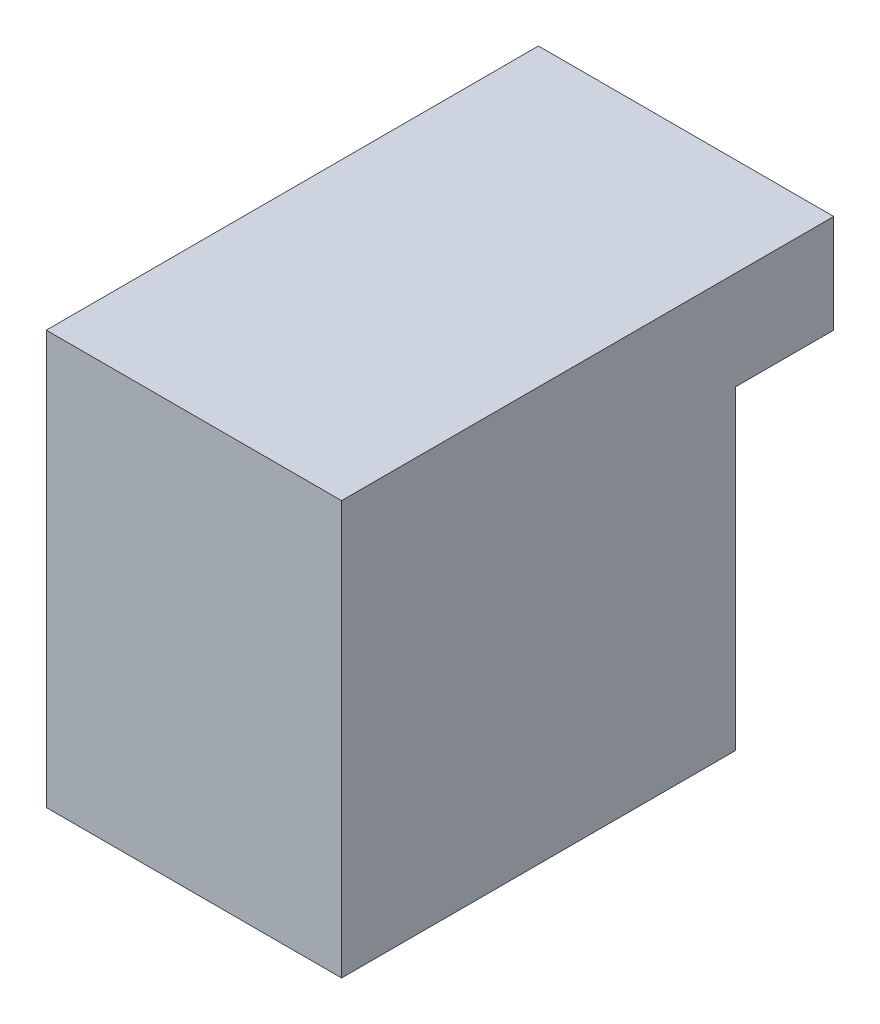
ISO-10303-21;
HEADER;
FILE_DESCRIPTION(('STEP AP214'),'2;1');
FILE_NAME('part.step','',(''),(''),'','','');
FILE_SCHEMA(('AUTOMOTIVE_DESIGN { 1 0 10303 214 1 1 1 1 }'));
ENDSEC;
DATA;
#1=APPLICATION_CONTEXT('core data for automotive mechanical design processes');
#2=APPLICATION_PROTOCOL_DEFINITION('international standard','automotive_design',2000,#1);
#3=PRODUCT_CONTEXT('',#1,'mechanical');
#4=PRODUCT('Part','Part','',(#3));
#5=PRODUCT_RELATED_PRODUCT_CATEGORY('part','',(#4));
#6=PRODUCT_DEFINITION_FORMATION('','',#4);
#7=PRODUCT_DEFINITION_CONTEXT('part definition',#1,'design');
#8=PRODUCT_DEFINITION('design','',#6,#7);
#9=PRODUCT_DEFINITION_SHAPE('','',#8);
#10=(LENGTH_UNIT() NAMED_UNIT(*) SI_UNIT(.MILLI.,.METRE.));
#11=(NAMED_UNIT(*) PLANE_ANGLE_UNIT() SI_UNIT($,.RADIAN.));
#12=(NAMED_UNIT(*) SI_UNIT($,.STERADIAN.) SOLID_ANGLE_UNIT());
#13=UNCERTAINTY_MEASURE_WITH_UNIT(LENGTH_MEASURE(1.E-05),#10,'distance_accuracy_value','');
#14=(GEOMETRIC_REPRESENTATION_CONTEXT(3) GLOBAL_UNCERTAINTY_ASSIGNED_CONTEXT((#13)) GLOBAL_UNIT_ASSIGNED_CONTEXT((#10,
#11,#12)) REPRESENTATION_CONTEXT('',''));
#15=CARTESIAN_POINT('',(0.,0.,0.));
#16=DIRECTION('',(0.,0.,1.));
#17=DIRECTION('',(1.,0.,0.));
#18=AXIS2_PLACEMENT_3D('',#15,#16,#17);
#19=CARTESIAN_POINT('',(7.5,7.90909090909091,-7.81818181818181));
#20=DIRECTION('',(0.,-1.,0.));
#21=DIRECTION('',(0.,0.,-1.));
#22=AXIS2_PLACEMENT_3D('',#19,#20,#21);
#23=PLANE('',#22);
#24=DIRECTION('',(0.,0.,1.));
#25=VECTOR('',#24,1.);
#26=CARTESIAN_POINT('',(-7.5,7.90909090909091,-7.81818181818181));
#27=LINE('',#26,#25);
#28=CARTESIAN_POINT('',(-7.5,7.90909090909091,-7.81818181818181));
#29=VERTEX_POINT('',#28);
#30=CARTESIAN_POINT('',(-7.5,7.90909090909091,17.1818181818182));
#31=VERTEX_POINT('',#30);
#32=EDGE_CURVE('E117',#29,#31,#27,.T.);
#33=ORIENTED_EDGE('',*,*,#32,.T.);
#34=DIRECTION('',(-1.,0.,0.));
#35=VECTOR('',#34,1.);
#36=CARTESIAN_POINT('',(7.5,7.90909090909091,17.1818181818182));
#37=LINE('',#36,#35);
#38=CARTESIAN_POINT('',(7.5,7.90909090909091,17.1818181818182));
#39=VERTEX_POINT('',#38);
#40=EDGE_CURVE('E11',#39,#31,#37,.T.);
#41=ORIENTED_EDGE('',*,*,#40,.F.);
#42=DIRECTION('',(0.,0.,1.));
#43=VECTOR('',#42,1.);
#44=CARTESIAN_POINT('',(7.5,7.90909090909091,-7.81818181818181));
#45=LINE('',#44,#43);
#46=CARTESIAN_POINT('',(7.5,7.90909090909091,-7.81818181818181));
#47=VERTEX_POINT('',#46);
#48=EDGE_CURVE('E127',#47,#39,#45,.T.);
#49=ORIENTED_EDGE('',*,*,#48,.F.);
#50=DIRECTION('',(-1.,0.,0.));
#51=VECTOR('',#50,1.);
#52=CARTESIAN_POINT('',(7.5,7.90909090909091,-7.81818181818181));
#53=LINE('',#52,#51);
#54=EDGE_CURVE('E113',#47,#29,#53,.T.);
#55=ORIENTED_EDGE('',*,*,#54,.T.);
#56=EDGE_LOOP('',(#33,#41,#49,#55));
#57=FACE_BOUND('',#56,.T.);
#58=ADVANCED_FACE('F33',(#57),#23,.F.);
#59=CARTESIAN_POINT('',(7.5,7.90909090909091,17.1818181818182));
#60=DIRECTION('',(0.,0.,-1.));
#61=DIRECTION('',(-1.,0.,0.));
#62=AXIS2_PLACEMENT_3D('',#59,#60,#61);
#63=PLANE('',#62);
#64=DIRECTION('',(0.,-1.,0.));
#65=VECTOR('',#64,1.);
#66=CARTESIAN_POINT('',(-7.5,7.90909090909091,17.1818181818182));
#67=LINE('',#66,#65);
#68=CARTESIAN_POINT('',(-7.5,-13.0909090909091,17.1818181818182));
#69=VERTEX_POINT('',#68);
#70=EDGE_CURVE('E120',#31,#69,#67,.T.);
#71=ORIENTED_EDGE('',*,*,#70,.T.);
#72=DIRECTION('',(-1.,0.,0.));
#73=VECTOR('',#72,1.);
#74=CARTESIAN_POINT('',(7.5,-13.0909090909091,17.1818181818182));
#75=LINE('',#74,#73);
#76=CARTESIAN_POINT('',(7.5,-13.0909090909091,17.1818181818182));
#77=VERTEX_POINT('',#76);
#78=EDGE_CURVE('E41',#77,#69,#75,.T.);
#79=ORIENTED_EDGE('',*,*,#78,.F.);
#80=DIRECTION('',(0.,-1.,0.));
#81=VECTOR('',#80,1.);
#82=CARTESIAN_POINT('',(7.5,7.90909090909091,17.1818181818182));
#83=LINE('',#82,#81);
#84=EDGE_CURVE('E86',#39,#77,#83,.T.);
#85=ORIENTED_EDGE('',*,*,#84,.F.);
#86=ORIENTED_EDGE('',*,*,#40,.T.);
#87=EDGE_LOOP('',(#71,#79,#85,#86));
#88=FACE_BOUND('',#87,.T.);
#89=ADVANCED_FACE('F151',(#88),#63,.F.);
#90=CARTESIAN_POINT('',(7.5,-13.0909090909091,17.1818181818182));
#91=DIRECTION('',(0.,1.,0.));
#92=DIRECTION('',(0.,0.,1.));
#93=AXIS2_PLACEMENT_3D('',#90,#91,#92);
#94=PLANE('',#93);
#95=DIRECTION('',(0.,0.,-1.));
#96=VECTOR('',#95,1.);
#97=CARTESIAN_POINT('',(-7.5,-13.0909090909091,17.1818181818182));
#98=LINE('',#97,#96);
#99=CARTESIAN_POINT('',(-7.5,-13.0909090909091,-2.81818181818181));
#100=VERTEX_POINT('',#99);
#101=EDGE_CURVE('E122',#69,#100,#98,.T.);
#102=ORIENTED_EDGE('',*,*,#101,.T.);
#103=DIRECTION('',(-1.,0.,0.));
#104=VECTOR('',#103,1.);
#105=CARTESIAN_POINT('',(7.5,-13.0909090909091,-2.81818181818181));
#106=LINE('',#105,#104);
#107=CARTESIAN_POINT('',(7.5,-13.0909090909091,-2.81818181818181));
#108=VERTEX_POINT('',#107);
#109=EDGE_CURVE('E108',#108,#100,#106,.T.);
#110=ORIENTED_EDGE('',*,*,#109,.F.);
#111=DIRECTION('',(0.,0.,-1.));
#112=VECTOR('',#111,1.);
#113=CARTESIAN_POINT('',(7.5,-13.0909090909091,17.1818181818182));
#114=LINE('',#113,#112);
#115=EDGE_CURVE('E99',#77,#108,#114,.T.);
#116=ORIENTED_EDGE('',*,*,#115,.F.);
#117=ORIENTED_EDGE('',*,*,#78,.T.);
#118=EDGE_LOOP('',(#102,#110,#116,#117));
#119=FACE_BOUND('',#118,.T.);
#120=ADVANCED_FACE('F133',(#119),#94,.F.);
#121=CARTESIAN_POINT('',(7.5,-13.0909090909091,-2.81818181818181));
#122=DIRECTION('',(0.,0.,1.));
#123=DIRECTION('',(1.,0.,0.));
#124=AXIS2_PLACEMENT_3D('',#121,#122,#123);
#125=PLANE('',#124);
#126=DIRECTION('',(0.,1.,0.));
#127=VECTOR('',#126,1.);
#128=CARTESIAN_POINT('',(-7.5,-13.0909090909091,-2.81818181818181));
#129=LINE('',#128,#127);
#130=CARTESIAN_POINT('',(-7.5,2.90909090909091,-2.81818181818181));
#131=VERTEX_POINT('',#130);
#132=EDGE_CURVE('E107',#100,#131,#129,.T.);
#133=ORIENTED_EDGE('',*,*,#132,.T.);
#134=DIRECTION('',(-1.,0.,0.));
#135=VECTOR('',#134,1.);
#136=CARTESIAN_POINT('',(7.5,2.90909090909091,-2.81818181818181));
#137=LINE('',#136,#135);
#138=CARTESIAN_POINT('',(7.5,2.90909090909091,-2.81818181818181));
#139=VERTEX_POINT('',#138);
#140=EDGE_CURVE('E104',#139,#131,#137,.T.);
#141=ORIENTED_EDGE('',*,*,#140,.F.);
#142=DIRECTION('',(0.,1.,0.));
#143=VECTOR('',#142,1.);
#144=CARTESIAN_POINT('',(7.5,-13.0909090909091,-2.81818181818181));
#145=LINE('',#144,#143);
#146=EDGE_CURVE('E93',#108,#139,#145,.T.);
#147=ORIENTED_EDGE('',*,*,#146,.F.);
#148=ORIENTED_EDGE('',*,*,#109,.T.);
#149=EDGE_LOOP('',(#133,#141,#147,#148));
#150=FACE_BOUND('',#149,.T.);
#151=ADVANCED_FACE('F105',(#150),#125,.F.);
#152=CARTESIAN_POINT('',(7.5,2.90909090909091,-2.81818181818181));
#153=DIRECTION('',(0.,1.,0.));
#154=DIRECTION('',(0.,0.,1.));
#155=AXIS2_PLACEMENT_3D('',#152,#153,#154);
#156=PLANE('',#155);
#157=DIRECTION('',(0.,0.,-1.));
#158=VECTOR('',#157,1.);
#159=CARTESIAN_POINT('',(-7.5,2.90909090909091,-2.81818181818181));
#160=LINE('',#159,#158);
#161=CARTESIAN_POINT('',(-7.5,2.90909090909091,-7.81818181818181));
#162=VERTEX_POINT('',#161);
#163=EDGE_CURVE('E72',#131,#162,#160,.T.);
#164=ORIENTED_EDGE('',*,*,#163,.T.);
#165=DIRECTION('',(-1.,0.,0.));
#166=VECTOR('',#165,1.);
#167=CARTESIAN_POINT('',(7.5,2.90909090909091,-7.81818181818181));
#168=LINE('',#167,#166);
#169=CARTESIAN_POINT('',(7.5,2.90909090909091,-7.81818181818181));
#170=VERTEX_POINT('',#169);
#171=EDGE_CURVE('E109',#170,#162,#168,.T.);
#172=ORIENTED_EDGE('',*,*,#171,.F.);
#173=DIRECTION('',(0.,0.,-1.));
#174=VECTOR('',#173,1.);
#175=CARTESIAN_POINT('',(7.5,2.90909090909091,-2.81818181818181));
#176=LINE('',#175,#174);
#177=EDGE_CURVE('E97',#139,#170,#176,.T.);
#178=ORIENTED_EDGE('',*,*,#177,.F.);
#179=ORIENTED_EDGE('',*,*,#140,.T.);
#180=EDGE_LOOP('',(#164,#172,#178,#179));
#181=FACE_BOUND('',#180,.T.);
#182=ADVANCED_FACE('F111',(#181),#156,.F.);
#183=CARTESIAN_POINT('',(7.5,2.90909090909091,-7.81818181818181));
#184=DIRECTION('',(0.,0.,1.));
#185=DIRECTION('',(1.,0.,0.));
#186=AXIS2_PLACEMENT_3D('',#183,#184,#185);
#187=PLANE('',#186);
#188=DIRECTION('',(0.,1.,0.));
#189=VECTOR('',#188,1.);
#190=CARTESIAN_POINT('',(-7.5,2.90909090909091,-7.81818181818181));
#191=LINE('',#190,#189);
#192=EDGE_CURVE('E78',#162,#29,#191,.T.);
#193=ORIENTED_EDGE('',*,*,#192,.T.);
#194=ORIENTED_EDGE('',*,*,#54,.F.);
#195=DIRECTION('',(0.,1.,0.));
#196=VECTOR('',#195,1.);
#197=CARTESIAN_POINT('',(7.5,2.90909090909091,-7.81818181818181));
#198=LINE('',#197,#196);
#199=EDGE_CURVE('E49',#170,#47,#198,.T.);
#200=ORIENTED_EDGE('',*,*,#199,.F.);
#201=ORIENTED_EDGE('',*,*,#171,.T.);
#202=EDGE_LOOP('',(#193,#194,#200,#201));
#203=FACE_BOUND('',#202,.T.);
#204=ADVANCED_FACE('F140',(#203),#187,.F.);
#205=CARTESIAN_POINT('',(7.5,0.,0.));
#206=DIRECTION('',(1.,0.,0.));
#207=DIRECTION('',(0.,0.,-1.));
#208=AXIS2_PLACEMENT_3D('',#205,#206,#207);
#209=PLANE('',#208);
#210=ORIENTED_EDGE('',*,*,#48,.T.);
#211=ORIENTED_EDGE('',*,*,#84,.T.);
#212=ORIENTED_EDGE('',*,*,#115,.T.);
#213=ORIENTED_EDGE('',*,*,#146,.T.);
#214=ORIENTED_EDGE('',*,*,#177,.T.);
#215=ORIENTED_EDGE('',*,*,#199,.T.);
#216=EDGE_LOOP('',(#210,#211,#212,#213,#214,#215));
#217=FACE_BOUND('',#216,.T.);
#218=ADVANCED_FACE('F95',(#217),#209,.T.);
#219=CARTESIAN_POINT('',(-7.5,0.,0.));
#220=DIRECTION('',(1.,0.,0.));
#221=DIRECTION('',(0.,0.,-1.));
#222=AXIS2_PLACEMENT_3D('',#219,#220,#221);
#223=PLANE('',#222);
#224=ORIENTED_EDGE('',*,*,#32,.F.);
#225=ORIENTED_EDGE('',*,*,#192,.F.);
#226=ORIENTED_EDGE('',*,*,#163,.F.);
#227=ORIENTED_EDGE('',*,*,#132,.F.);
#228=ORIENTED_EDGE('',*,*,#101,.F.);
#229=ORIENTED_EDGE('',*,*,#70,.F.);
#230=EDGE_LOOP('',(#224,#225,#226,#227,#228,#229));
#231=FACE_BOUND('',#230,.T.);
#232=ADVANCED_FACE('F136',(#231),#223,.F.);
#233=CLOSED_SHELL('',(#58,#89,#120,#151,#182,#204,#218,#232));
#234=MANIFOLD_SOLID_BREP('B2',#233);
#235=ADVANCED_BREP_SHAPE_REPRESENTATION('',(#18,#234),#14);
#236=SHAPE_DEFINITION_REPRESENTATION(#9,#235);
ENDSEC;
END-ISO-10303-21;
